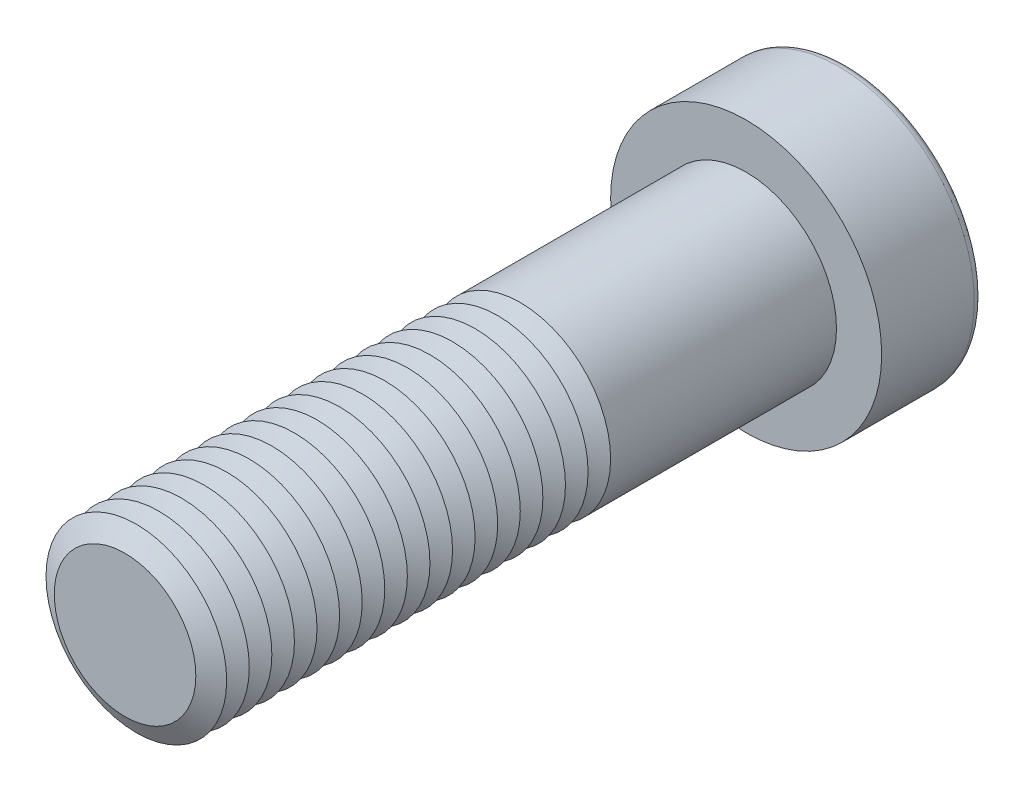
ISO-10303-21;
HEADER;
FILE_DESCRIPTION(('STEP AP214'),'2;1');
FILE_NAME('part.step','',(''),(''),'','','');
FILE_SCHEMA(('AUTOMOTIVE_DESIGN { 1 0 10303 214 1 1 1 1 }'));
ENDSEC;
DATA;
#1=APPLICATION_CONTEXT('core data for automotive mechanical design processes');
#2=APPLICATION_PROTOCOL_DEFINITION('international standard','automotive_design',2000,#1);
#3=PRODUCT_CONTEXT('',#1,'mechanical');
#4=PRODUCT('Part','Part','',(#3));
#5=PRODUCT_RELATED_PRODUCT_CATEGORY('part','',(#4));
#6=PRODUCT_DEFINITION_FORMATION('','',#4);
#7=PRODUCT_DEFINITION_CONTEXT('part definition',#1,'design');
#8=PRODUCT_DEFINITION('design','',#6,#7);
#9=PRODUCT_DEFINITION_SHAPE('','',#8);
#10=(LENGTH_UNIT() NAMED_UNIT(*) SI_UNIT(.MILLI.,.METRE.));
#11=(NAMED_UNIT(*) PLANE_ANGLE_UNIT() SI_UNIT($,.RADIAN.));
#12=(NAMED_UNIT(*) SI_UNIT($,.STERADIAN.) SOLID_ANGLE_UNIT());
#13=UNCERTAINTY_MEASURE_WITH_UNIT(LENGTH_MEASURE(1.E-05),#10,'distance_accuracy_value','');
#14=(GEOMETRIC_REPRESENTATION_CONTEXT(3) GLOBAL_UNCERTAINTY_ASSIGNED_CONTEXT((#13)) GLOBAL_UNIT_ASSIGNED_CONTEXT((#10,
#11,#12)) REPRESENTATION_CONTEXT('',''));
#15=CARTESIAN_POINT('',(0.,0.,0.));
#16=DIRECTION('',(0.,0.,1.));
#17=DIRECTION('',(1.,0.,0.));
#18=AXIS2_PLACEMENT_3D('',#15,#16,#17);
#19=CARTESIAN_POINT('',(0.,0.,48.));
#20=DIRECTION('',(0.,0.,1.));
#21=DIRECTION('',(1.,0.,0.));
#22=AXIS2_PLACEMENT_3D('',#19,#20,#21);
#23=CONICAL_SURFACE('',#22,8.,1.0471975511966);
#24=CARTESIAN_POINT('',(0.,0.,47.));
#25=DIRECTION('',(0.,0.,1.));
#26=DIRECTION('',(1.,0.,0.));
#27=AXIS2_PLACEMENT_3D('',#24,#25,#26);
#28=CIRCLE('',#27,6.26794919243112);
#29=CARTESIAN_POINT('',(6.26794919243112,0.,47.));
#30=VERTEX_POINT('',#29);
#31=EDGE_CURVE('E314',#30,#30,#28,.T.);
#32=ORIENTED_EDGE('',*,*,#31,.T.);
#33=EDGE_LOOP('',(#32));
#34=FACE_BOUND('',#33,.T.);
#35=CARTESIAN_POINT('',(0.,0.,48.));
#36=DIRECTION('',(0.,0.,1.));
#37=DIRECTION('',(1.,0.,0.));
#38=AXIS2_PLACEMENT_3D('',#35,#36,#37);
#39=CIRCLE('',#38,8.);
#40=CARTESIAN_POINT('',(8.,0.,48.));
#41=VERTEX_POINT('',#40);
#42=EDGE_CURVE('E317',#41,#41,#39,.T.);
#43=ORIENTED_EDGE('',*,*,#42,.F.);
#44=EDGE_LOOP('',(#43));
#45=FACE_BOUND('',#44,.T.);
#46=ADVANCED_FACE('F39',(#34,#45),#23,.T.);
#47=CARTESIAN_POINT('',(0.,0.,47.));
#48=DIRECTION('',(0.,0.,-1.));
#49=DIRECTION('',(-1.,0.,0.));
#50=AXIS2_PLACEMENT_3D('',#47,#48,#49);
#51=CONICAL_SURFACE('',#50,6.26794919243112,1.0471975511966);
#52=CARTESIAN_POINT('',(0.,0.,46.));
#53=DIRECTION('',(0.,0.,1.));
#54=DIRECTION('',(1.,0.,0.));
#55=AXIS2_PLACEMENT_3D('',#52,#53,#54);
#56=CIRCLE('',#55,8.);
#57=CARTESIAN_POINT('',(8.,0.,46.));
#58=VERTEX_POINT('',#57);
#59=EDGE_CURVE('E324',#58,#58,#56,.T.);
#60=ORIENTED_EDGE('',*,*,#59,.T.);
#61=EDGE_LOOP('',(#60));
#62=FACE_BOUND('',#61,.T.);
#63=ORIENTED_EDGE('',*,*,#31,.F.);
#64=EDGE_LOOP('',(#63));
#65=FACE_BOUND('',#64,.T.);
#66=ADVANCED_FACE('F245',(#62,#65),#51,.T.);
#67=CARTESIAN_POINT('',(0.,0.,55.));
#68=DIRECTION('',(0.,0.,1.));
#69=DIRECTION('',(1.,0.,0.));
#70=AXIS2_PLACEMENT_3D('',#67,#68,#69);
#71=PLANE('',#70);
#72=CARTESIAN_POINT('',(0.,0.,55.));
#73=DIRECTION('',(0.,0.,1.));
#74=DIRECTION('',(1.,0.,0.));
#75=AXIS2_PLACEMENT_3D('',#72,#73,#74);
#76=CIRCLE('',#75,6.26794919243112);
#77=CARTESIAN_POINT('',(6.26794919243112,0.,55.));
#78=VERTEX_POINT('',#77);
#79=EDGE_CURVE('E174',#78,#78,#76,.T.);
#80=ORIENTED_EDGE('',*,*,#79,.T.);
#81=EDGE_LOOP('',(#80));
#82=FACE_BOUND('',#81,.T.);
#83=ADVANCED_FACE('F251',(#82),#71,.T.);
#84=CARTESIAN_POINT('',(0.,0.,55.));
#85=DIRECTION('',(0.,0.,-1.));
#86=DIRECTION('',(-1.,0.,0.));
#87=AXIS2_PLACEMENT_3D('',#84,#85,#86);
#88=CONICAL_SURFACE('',#87,6.26794919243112,1.0471975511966);
#89=CARTESIAN_POINT('',(0.,0.,54.));
#90=DIRECTION('',(0.,0.,1.));
#91=DIRECTION('',(1.,0.,0.));
#92=AXIS2_PLACEMENT_3D('',#89,#90,#91);
#93=CIRCLE('',#92,8.);
#94=CARTESIAN_POINT('',(8.,0.,54.));
#95=VERTEX_POINT('',#94);
#96=EDGE_CURVE('E291',#95,#95,#93,.T.);
#97=ORIENTED_EDGE('',*,*,#96,.T.);
#98=EDGE_LOOP('',(#97));
#99=FACE_BOUND('',#98,.T.);
#100=ORIENTED_EDGE('',*,*,#79,.F.);
#101=EDGE_LOOP('',(#100));
#102=FACE_BOUND('',#101,.T.);
#103=ADVANCED_FACE('F199',(#99,#102),#88,.T.);
#104=CARTESIAN_POINT('',(0.,0.,54.));
#105=DIRECTION('',(0.,0.,1.));
#106=DIRECTION('',(1.,0.,0.));
#107=AXIS2_PLACEMENT_3D('',#104,#105,#106);
#108=CONICAL_SURFACE('',#107,8.,1.0471975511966);
#109=CARTESIAN_POINT('',(0.,0.,53.));
#110=DIRECTION('',(0.,0.,1.));
#111=DIRECTION('',(1.,0.,0.));
#112=AXIS2_PLACEMENT_3D('',#109,#110,#111);
#113=CIRCLE('',#112,6.26794919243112);
#114=CARTESIAN_POINT('',(6.26794919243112,0.,53.));
#115=VERTEX_POINT('',#114);
#116=EDGE_CURVE('E288',#115,#115,#113,.T.);
#117=ORIENTED_EDGE('',*,*,#116,.T.);
#118=EDGE_LOOP('',(#117));
#119=FACE_BOUND('',#118,.T.);
#120=ORIENTED_EDGE('',*,*,#96,.F.);
#121=EDGE_LOOP('',(#120));
#122=FACE_BOUND('',#121,.T.);
#123=ADVANCED_FACE('F277',(#119,#122),#108,.T.);
#124=CARTESIAN_POINT('',(0.,0.,53.));
#125=DIRECTION('',(0.,0.,-1.));
#126=DIRECTION('',(-1.,0.,0.));
#127=AXIS2_PLACEMENT_3D('',#124,#125,#126);
#128=CONICAL_SURFACE('',#127,6.26794919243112,1.0471975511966);
#129=CARTESIAN_POINT('',(0.,0.,52.));
#130=DIRECTION('',(0.,0.,1.));
#131=DIRECTION('',(1.,0.,0.));
#132=AXIS2_PLACEMENT_3D('',#129,#130,#131);
#133=CIRCLE('',#132,8.);
#134=CARTESIAN_POINT('',(8.,0.,52.));
#135=VERTEX_POINT('',#134);
#136=EDGE_CURVE('E300',#135,#135,#133,.T.);
#137=ORIENTED_EDGE('',*,*,#136,.T.);
#138=EDGE_LOOP('',(#137));
#139=FACE_BOUND('',#138,.T.);
#140=ORIENTED_EDGE('',*,*,#116,.F.);
#141=EDGE_LOOP('',(#140));
#142=FACE_BOUND('',#141,.T.);
#143=ADVANCED_FACE('F274',(#139,#142),#128,.T.);
#144=CARTESIAN_POINT('',(0.,0.,52.));
#145=DIRECTION('',(0.,0.,1.));
#146=DIRECTION('',(1.,0.,0.));
#147=AXIS2_PLACEMENT_3D('',#144,#145,#146);
#148=CONICAL_SURFACE('',#147,8.,1.0471975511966);
#149=CARTESIAN_POINT('',(0.,0.,51.));
#150=DIRECTION('',(0.,0.,1.));
#151=DIRECTION('',(1.,0.,0.));
#152=AXIS2_PLACEMENT_3D('',#149,#150,#151);
#153=CIRCLE('',#152,6.26794919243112);
#154=CARTESIAN_POINT('',(6.26794919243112,0.,51.));
#155=VERTEX_POINT('',#154);
#156=EDGE_CURVE('E293',#155,#155,#153,.T.);
#157=ORIENTED_EDGE('',*,*,#156,.T.);
#158=EDGE_LOOP('',(#157));
#159=FACE_BOUND('',#158,.T.);
#160=ORIENTED_EDGE('',*,*,#136,.F.);
#161=EDGE_LOOP('',(#160));
#162=FACE_BOUND('',#161,.T.);
#163=ADVANCED_FACE('F270',(#159,#162),#148,.T.);
#164=CARTESIAN_POINT('',(0.,0.,51.));
#165=DIRECTION('',(0.,0.,-1.));
#166=DIRECTION('',(-1.,0.,0.));
#167=AXIS2_PLACEMENT_3D('',#164,#165,#166);
#168=CONICAL_SURFACE('',#167,6.26794919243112,1.0471975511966);
#169=CARTESIAN_POINT('',(0.,0.,50.));
#170=DIRECTION('',(0.,0.,1.));
#171=DIRECTION('',(1.,0.,0.));
#172=AXIS2_PLACEMENT_3D('',#169,#170,#171);
#173=CIRCLE('',#172,8.);
#174=CARTESIAN_POINT('',(8.,0.,50.));
#175=VERTEX_POINT('',#174);
#176=EDGE_CURVE('E310',#175,#175,#173,.T.);
#177=ORIENTED_EDGE('',*,*,#176,.T.);
#178=EDGE_LOOP('',(#177));
#179=FACE_BOUND('',#178,.T.);
#180=ORIENTED_EDGE('',*,*,#156,.F.);
#181=EDGE_LOOP('',(#180));
#182=FACE_BOUND('',#181,.T.);
#183=ADVANCED_FACE('F266',(#179,#182),#168,.T.);
#184=CARTESIAN_POINT('',(0.,0.,50.));
#185=DIRECTION('',(0.,0.,1.));
#186=DIRECTION('',(1.,0.,0.));
#187=AXIS2_PLACEMENT_3D('',#184,#185,#186);
#188=CONICAL_SURFACE('',#187,8.,1.0471975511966);
#189=CARTESIAN_POINT('',(0.,0.,49.));
#190=DIRECTION('',(0.,0.,1.));
#191=DIRECTION('',(1.,0.,0.));
#192=AXIS2_PLACEMENT_3D('',#189,#190,#191);
#193=CIRCLE('',#192,6.26794919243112);
#194=CARTESIAN_POINT('',(6.26794919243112,0.,49.));
#195=VERTEX_POINT('',#194);
#196=EDGE_CURVE('E306',#195,#195,#193,.T.);
#197=ORIENTED_EDGE('',*,*,#196,.T.);
#198=EDGE_LOOP('',(#197));
#199=FACE_BOUND('',#198,.T.);
#200=ORIENTED_EDGE('',*,*,#176,.F.);
#201=EDGE_LOOP('',(#200));
#202=FACE_BOUND('',#201,.T.);
#203=ADVANCED_FACE('F262',(#199,#202),#188,.T.);
#204=CARTESIAN_POINT('',(0.,0.,49.));
#205=DIRECTION('',(0.,0.,-1.));
#206=DIRECTION('',(-1.,0.,0.));
#207=AXIS2_PLACEMENT_3D('',#204,#205,#206);
#208=CONICAL_SURFACE('',#207,6.26794919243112,1.0471975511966);
#209=ORIENTED_EDGE('',*,*,#42,.T.);
#210=EDGE_LOOP('',(#209));
#211=FACE_BOUND('',#210,.T.);
#212=ORIENTED_EDGE('',*,*,#196,.F.);
#213=EDGE_LOOP('',(#212));
#214=FACE_BOUND('',#213,.T.);
#215=ADVANCED_FACE('F258',(#211,#214),#208,.T.);
#216=CARTESIAN_POINT('',(0.,0.,46.));
#217=DIRECTION('',(0.,0.,1.));
#218=DIRECTION('',(1.,0.,0.));
#219=AXIS2_PLACEMENT_3D('',#216,#217,#218);
#220=CONICAL_SURFACE('',#219,8.,1.0471975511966);
#221=CARTESIAN_POINT('',(0.,0.,45.));
#222=DIRECTION('',(0.,0.,1.));
#223=DIRECTION('',(1.,0.,0.));
#224=AXIS2_PLACEMENT_3D('',#221,#222,#223);
#225=CIRCLE('',#224,6.26794919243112);
#226=CARTESIAN_POINT('',(6.26794919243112,0.,45.));
#227=VERTEX_POINT('',#226);
#228=EDGE_CURVE('E321',#227,#227,#225,.T.);
#229=ORIENTED_EDGE('',*,*,#228,.T.);
#230=EDGE_LOOP('',(#229));
#231=FACE_BOUND('',#230,.T.);
#232=ORIENTED_EDGE('',*,*,#59,.F.);
#233=EDGE_LOOP('',(#232));
#234=FACE_BOUND('',#233,.T.);
#235=ADVANCED_FACE('F261',(#231,#234),#220,.T.);
#236=CARTESIAN_POINT('',(0.,0.,45.));
#237=DIRECTION('',(0.,0.,-1.));
#238=DIRECTION('',(-1.,0.,0.));
#239=AXIS2_PLACEMENT_3D('',#236,#237,#238);
#240=CONICAL_SURFACE('',#239,6.26794919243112,1.0471975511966);
#241=CARTESIAN_POINT('',(0.,0.,44.));
#242=DIRECTION('',(0.,0.,1.));
#243=DIRECTION('',(1.,0.,0.));
#244=AXIS2_PLACEMENT_3D('',#241,#242,#243);
#245=CIRCLE('',#244,8.);
#246=CARTESIAN_POINT('',(8.,0.,44.));
#247=VERTEX_POINT('',#246);
#248=EDGE_CURVE('E332',#247,#247,#245,.T.);
#249=ORIENTED_EDGE('',*,*,#248,.T.);
#250=EDGE_LOOP('',(#249));
#251=FACE_BOUND('',#250,.T.);
#252=ORIENTED_EDGE('',*,*,#228,.F.);
#253=EDGE_LOOP('',(#252));
#254=FACE_BOUND('',#253,.T.);
#255=ADVANCED_FACE('F528',(#251,#254),#240,.T.);
#256=CARTESIAN_POINT('',(0.,0.,44.));
#257=DIRECTION('',(0.,0.,1.));
#258=DIRECTION('',(1.,0.,0.));
#259=AXIS2_PLACEMENT_3D('',#256,#257,#258);
#260=CONICAL_SURFACE('',#259,8.,1.0471975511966);
#261=CARTESIAN_POINT('',(0.,0.,43.));
#262=DIRECTION('',(0.,0.,1.));
#263=DIRECTION('',(1.,0.,0.));
#264=AXIS2_PLACEMENT_3D('',#261,#262,#263);
#265=CIRCLE('',#264,6.26794919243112);
#266=CARTESIAN_POINT('',(6.26794919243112,0.,43.));
#267=VERTEX_POINT('',#266);
#268=EDGE_CURVE('E328',#267,#267,#265,.T.);
#269=ORIENTED_EDGE('',*,*,#268,.T.);
#270=EDGE_LOOP('',(#269));
#271=FACE_BOUND('',#270,.T.);
#272=ORIENTED_EDGE('',*,*,#248,.F.);
#273=EDGE_LOOP('',(#272));
#274=FACE_BOUND('',#273,.T.);
#275=ADVANCED_FACE('F524',(#271,#274),#260,.T.);
#276=CARTESIAN_POINT('',(0.,0.,43.));
#277=DIRECTION('',(0.,0.,-1.));
#278=DIRECTION('',(-1.,0.,0.));
#279=AXIS2_PLACEMENT_3D('',#276,#277,#278);
#280=CONICAL_SURFACE('',#279,6.26794919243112,1.0471975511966);
#281=CARTESIAN_POINT('',(0.,0.,42.));
#282=DIRECTION('',(0.,0.,1.));
#283=DIRECTION('',(1.,0.,0.));
#284=AXIS2_PLACEMENT_3D('',#281,#282,#283);
#285=CIRCLE('',#284,8.);
#286=CARTESIAN_POINT('',(8.,0.,42.));
#287=VERTEX_POINT('',#286);
#288=EDGE_CURVE('E340',#287,#287,#285,.T.);
#289=ORIENTED_EDGE('',*,*,#288,.T.);
#290=EDGE_LOOP('',(#289));
#291=FACE_BOUND('',#290,.T.);
#292=ORIENTED_EDGE('',*,*,#268,.F.);
#293=EDGE_LOOP('',(#292));
#294=FACE_BOUND('',#293,.T.);
#295=ADVANCED_FACE('F520',(#291,#294),#280,.T.);
#296=CARTESIAN_POINT('',(0.,0.,42.));
#297=DIRECTION('',(0.,0.,1.));
#298=DIRECTION('',(1.,0.,0.));
#299=AXIS2_PLACEMENT_3D('',#296,#297,#298);
#300=CONICAL_SURFACE('',#299,8.,1.0471975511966);
#301=CARTESIAN_POINT('',(0.,0.,41.));
#302=DIRECTION('',(0.,0.,1.));
#303=DIRECTION('',(1.,0.,0.));
#304=AXIS2_PLACEMENT_3D('',#301,#302,#303);
#305=CIRCLE('',#304,6.26794919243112);
#306=CARTESIAN_POINT('',(6.26794919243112,0.,41.));
#307=VERTEX_POINT('',#306);
#308=EDGE_CURVE('E336',#307,#307,#305,.T.);
#309=ORIENTED_EDGE('',*,*,#308,.T.);
#310=EDGE_LOOP('',(#309));
#311=FACE_BOUND('',#310,.T.);
#312=ORIENTED_EDGE('',*,*,#288,.F.);
#313=EDGE_LOOP('',(#312));
#314=FACE_BOUND('',#313,.T.);
#315=ADVANCED_FACE('F516',(#311,#314),#300,.T.);
#316=CARTESIAN_POINT('',(0.,0.,41.));
#317=DIRECTION('',(0.,0.,-1.));
#318=DIRECTION('',(-1.,0.,0.));
#319=AXIS2_PLACEMENT_3D('',#316,#317,#318);
#320=CONICAL_SURFACE('',#319,6.26794919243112,1.0471975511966);
#321=CARTESIAN_POINT('',(0.,0.,40.));
#322=DIRECTION('',(0.,0.,1.));
#323=DIRECTION('',(1.,0.,0.));
#324=AXIS2_PLACEMENT_3D('',#321,#322,#323);
#325=CIRCLE('',#324,8.);
#326=CARTESIAN_POINT('',(8.,0.,40.));
#327=VERTEX_POINT('',#326);
#328=EDGE_CURVE('E348',#327,#327,#325,.T.);
#329=ORIENTED_EDGE('',*,*,#328,.T.);
#330=EDGE_LOOP('',(#329));
#331=FACE_BOUND('',#330,.T.);
#332=ORIENTED_EDGE('',*,*,#308,.F.);
#333=EDGE_LOOP('',(#332));
#334=FACE_BOUND('',#333,.T.);
#335=ADVANCED_FACE('F512',(#331,#334),#320,.T.);
#336=CARTESIAN_POINT('',(0.,0.,40.));
#337=DIRECTION('',(0.,0.,1.));
#338=DIRECTION('',(1.,0.,0.));
#339=AXIS2_PLACEMENT_3D('',#336,#337,#338);
#340=CONICAL_SURFACE('',#339,8.,1.0471975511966);
#341=CARTESIAN_POINT('',(0.,0.,39.));
#342=DIRECTION('',(0.,0.,1.));
#343=DIRECTION('',(1.,0.,0.));
#344=AXIS2_PLACEMENT_3D('',#341,#342,#343);
#345=CIRCLE('',#344,6.26794919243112);
#346=CARTESIAN_POINT('',(6.26794919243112,0.,39.));
#347=VERTEX_POINT('',#346);
#348=EDGE_CURVE('E344',#347,#347,#345,.T.);
#349=ORIENTED_EDGE('',*,*,#348,.T.);
#350=EDGE_LOOP('',(#349));
#351=FACE_BOUND('',#350,.T.);
#352=ORIENTED_EDGE('',*,*,#328,.F.);
#353=EDGE_LOOP('',(#352));
#354=FACE_BOUND('',#353,.T.);
#355=ADVANCED_FACE('F508',(#351,#354),#340,.T.);
#356=CARTESIAN_POINT('',(0.,0.,39.));
#357=DIRECTION('',(0.,0.,-1.));
#358=DIRECTION('',(-1.,0.,0.));
#359=AXIS2_PLACEMENT_3D('',#356,#357,#358);
#360=CONICAL_SURFACE('',#359,6.26794919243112,1.0471975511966);
#361=CARTESIAN_POINT('',(0.,0.,38.));
#362=DIRECTION('',(0.,0.,1.));
#363=DIRECTION('',(1.,0.,0.));
#364=AXIS2_PLACEMENT_3D('',#361,#362,#363);
#365=CIRCLE('',#364,8.);
#366=CARTESIAN_POINT('',(8.,0.,38.));
#367=VERTEX_POINT('',#366);
#368=EDGE_CURVE('E356',#367,#367,#365,.T.);
#369=ORIENTED_EDGE('',*,*,#368,.T.);
#370=EDGE_LOOP('',(#369));
#371=FACE_BOUND('',#370,.T.);
#372=ORIENTED_EDGE('',*,*,#348,.F.);
#373=EDGE_LOOP('',(#372));
#374=FACE_BOUND('',#373,.T.);
#375=ADVANCED_FACE('F504',(#371,#374),#360,.T.);
#376=CARTESIAN_POINT('',(0.,0.,38.));
#377=DIRECTION('',(0.,0.,1.));
#378=DIRECTION('',(1.,0.,0.));
#379=AXIS2_PLACEMENT_3D('',#376,#377,#378);
#380=CONICAL_SURFACE('',#379,8.,1.0471975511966);
#381=CARTESIAN_POINT('',(0.,0.,37.));
#382=DIRECTION('',(0.,0.,1.));
#383=DIRECTION('',(1.,0.,0.));
#384=AXIS2_PLACEMENT_3D('',#381,#382,#383);
#385=CIRCLE('',#384,6.26794919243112);
#386=CARTESIAN_POINT('',(6.26794919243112,0.,37.));
#387=VERTEX_POINT('',#386);
#388=EDGE_CURVE('E352',#387,#387,#385,.T.);
#389=ORIENTED_EDGE('',*,*,#388,.T.);
#390=EDGE_LOOP('',(#389));
#391=FACE_BOUND('',#390,.T.);
#392=ORIENTED_EDGE('',*,*,#368,.F.);
#393=EDGE_LOOP('',(#392));
#394=FACE_BOUND('',#393,.T.);
#395=ADVANCED_FACE('F500',(#391,#394),#380,.T.);
#396=CARTESIAN_POINT('',(0.,0.,37.));
#397=DIRECTION('',(0.,0.,-1.));
#398=DIRECTION('',(-1.,0.,0.));
#399=AXIS2_PLACEMENT_3D('',#396,#397,#398);
#400=CONICAL_SURFACE('',#399,6.26794919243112,1.0471975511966);
#401=CARTESIAN_POINT('',(0.,0.,36.));
#402=DIRECTION('',(0.,0.,1.));
#403=DIRECTION('',(1.,0.,0.));
#404=AXIS2_PLACEMENT_3D('',#401,#402,#403);
#405=CIRCLE('',#404,8.);
#406=CARTESIAN_POINT('',(8.,0.,36.));
#407=VERTEX_POINT('',#406);
#408=EDGE_CURVE('E364',#407,#407,#405,.T.);
#409=ORIENTED_EDGE('',*,*,#408,.T.);
#410=EDGE_LOOP('',(#409));
#411=FACE_BOUND('',#410,.T.);
#412=ORIENTED_EDGE('',*,*,#388,.F.);
#413=EDGE_LOOP('',(#412));
#414=FACE_BOUND('',#413,.T.);
#415=ADVANCED_FACE('F496',(#411,#414),#400,.T.);
#416=CARTESIAN_POINT('',(0.,0.,36.));
#417=DIRECTION('',(0.,0.,1.));
#418=DIRECTION('',(1.,0.,0.));
#419=AXIS2_PLACEMENT_3D('',#416,#417,#418);
#420=CONICAL_SURFACE('',#419,8.,1.0471975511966);
#421=CARTESIAN_POINT('',(0.,0.,35.));
#422=DIRECTION('',(0.,0.,1.));
#423=DIRECTION('',(1.,0.,0.));
#424=AXIS2_PLACEMENT_3D('',#421,#422,#423);
#425=CIRCLE('',#424,6.26794919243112);
#426=CARTESIAN_POINT('',(6.26794919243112,0.,35.));
#427=VERTEX_POINT('',#426);
#428=EDGE_CURVE('E360',#427,#427,#425,.T.);
#429=ORIENTED_EDGE('',*,*,#428,.T.);
#430=EDGE_LOOP('',(#429));
#431=FACE_BOUND('',#430,.T.);
#432=ORIENTED_EDGE('',*,*,#408,.F.);
#433=EDGE_LOOP('',(#432));
#434=FACE_BOUND('',#433,.T.);
#435=ADVANCED_FACE('F492',(#431,#434),#420,.T.);
#436=CARTESIAN_POINT('',(0.,0.,35.));
#437=DIRECTION('',(0.,0.,-1.));
#438=DIRECTION('',(-1.,0.,0.));
#439=AXIS2_PLACEMENT_3D('',#436,#437,#438);
#440=CONICAL_SURFACE('',#439,6.26794919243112,1.0471975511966);
#441=CARTESIAN_POINT('',(0.,0.,34.));
#442=DIRECTION('',(0.,0.,1.));
#443=DIRECTION('',(1.,0.,0.));
#444=AXIS2_PLACEMENT_3D('',#441,#442,#443);
#445=CIRCLE('',#444,8.);
#446=CARTESIAN_POINT('',(8.,0.,34.));
#447=VERTEX_POINT('',#446);
#448=EDGE_CURVE('E372',#447,#447,#445,.T.);
#449=ORIENTED_EDGE('',*,*,#448,.T.);
#450=EDGE_LOOP('',(#449));
#451=FACE_BOUND('',#450,.T.);
#452=ORIENTED_EDGE('',*,*,#428,.F.);
#453=EDGE_LOOP('',(#452));
#454=FACE_BOUND('',#453,.T.);
#455=ADVANCED_FACE('F488',(#451,#454),#440,.T.);
#456=CARTESIAN_POINT('',(0.,0.,34.));
#457=DIRECTION('',(0.,0.,1.));
#458=DIRECTION('',(1.,0.,0.));
#459=AXIS2_PLACEMENT_3D('',#456,#457,#458);
#460=CONICAL_SURFACE('',#459,8.,1.0471975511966);
#461=CARTESIAN_POINT('',(0.,0.,33.));
#462=DIRECTION('',(0.,0.,1.));
#463=DIRECTION('',(1.,0.,0.));
#464=AXIS2_PLACEMENT_3D('',#461,#462,#463);
#465=CIRCLE('',#464,6.26794919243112);
#466=CARTESIAN_POINT('',(6.26794919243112,0.,33.));
#467=VERTEX_POINT('',#466);
#468=EDGE_CURVE('E368',#467,#467,#465,.T.);
#469=ORIENTED_EDGE('',*,*,#468,.T.);
#470=EDGE_LOOP('',(#469));
#471=FACE_BOUND('',#470,.T.);
#472=ORIENTED_EDGE('',*,*,#448,.F.);
#473=EDGE_LOOP('',(#472));
#474=FACE_BOUND('',#473,.T.);
#475=ADVANCED_FACE('F484',(#471,#474),#460,.T.);
#476=CARTESIAN_POINT('',(0.,0.,33.));
#477=DIRECTION('',(0.,0.,-1.));
#478=DIRECTION('',(-1.,0.,0.));
#479=AXIS2_PLACEMENT_3D('',#476,#477,#478);
#480=CONICAL_SURFACE('',#479,6.26794919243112,1.0471975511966);
#481=CARTESIAN_POINT('',(0.,0.,32.));
#482=DIRECTION('',(0.,0.,1.));
#483=DIRECTION('',(1.,0.,0.));
#484=AXIS2_PLACEMENT_3D('',#481,#482,#483);
#485=CIRCLE('',#484,8.);
#486=CARTESIAN_POINT('',(8.,0.,32.));
#487=VERTEX_POINT('',#486);
#488=EDGE_CURVE('E380',#487,#487,#485,.T.);
#489=ORIENTED_EDGE('',*,*,#488,.T.);
#490=EDGE_LOOP('',(#489));
#491=FACE_BOUND('',#490,.T.);
#492=ORIENTED_EDGE('',*,*,#468,.F.);
#493=EDGE_LOOP('',(#492));
#494=FACE_BOUND('',#493,.T.);
#495=ADVANCED_FACE('F480',(#491,#494),#480,.T.);
#496=CARTESIAN_POINT('',(0.,0.,32.));
#497=DIRECTION('',(0.,0.,1.));
#498=DIRECTION('',(1.,0.,0.));
#499=AXIS2_PLACEMENT_3D('',#496,#497,#498);
#500=CONICAL_SURFACE('',#499,8.,1.0471975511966);
#501=CARTESIAN_POINT('',(0.,0.,31.));
#502=DIRECTION('',(0.,0.,1.));
#503=DIRECTION('',(1.,0.,0.));
#504=AXIS2_PLACEMENT_3D('',#501,#502,#503);
#505=CIRCLE('',#504,6.26794919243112);
#506=CARTESIAN_POINT('',(6.26794919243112,0.,31.));
#507=VERTEX_POINT('',#506);
#508=EDGE_CURVE('E376',#507,#507,#505,.T.);
#509=ORIENTED_EDGE('',*,*,#508,.T.);
#510=EDGE_LOOP('',(#509));
#511=FACE_BOUND('',#510,.T.);
#512=ORIENTED_EDGE('',*,*,#488,.F.);
#513=EDGE_LOOP('',(#512));
#514=FACE_BOUND('',#513,.T.);
#515=ADVANCED_FACE('F476',(#511,#514),#500,.T.);
#516=CARTESIAN_POINT('',(0.,0.,31.));
#517=DIRECTION('',(0.,0.,-1.));
#518=DIRECTION('',(-1.,0.,0.));
#519=AXIS2_PLACEMENT_3D('',#516,#517,#518);
#520=CONICAL_SURFACE('',#519,6.26794919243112,1.0471975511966);
#521=CARTESIAN_POINT('',(0.,0.,30.));
#522=DIRECTION('',(0.,0.,1.));
#523=DIRECTION('',(1.,0.,0.));
#524=AXIS2_PLACEMENT_3D('',#521,#522,#523);
#525=CIRCLE('',#524,8.);
#526=CARTESIAN_POINT('',(8.,0.,30.));
#527=VERTEX_POINT('',#526);
#528=EDGE_CURVE('E388',#527,#527,#525,.T.);
#529=ORIENTED_EDGE('',*,*,#528,.T.);
#530=EDGE_LOOP('',(#529));
#531=FACE_BOUND('',#530,.T.);
#532=ORIENTED_EDGE('',*,*,#508,.F.);
#533=EDGE_LOOP('',(#532));
#534=FACE_BOUND('',#533,.T.);
#535=ADVANCED_FACE('F472',(#531,#534),#520,.T.);
#536=CARTESIAN_POINT('',(0.,0.,30.));
#537=DIRECTION('',(0.,0.,1.));
#538=DIRECTION('',(1.,0.,0.));
#539=AXIS2_PLACEMENT_3D('',#536,#537,#538);
#540=CONICAL_SURFACE('',#539,8.,1.0471975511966);
#541=CARTESIAN_POINT('',(0.,0.,29.));
#542=DIRECTION('',(0.,0.,1.));
#543=DIRECTION('',(1.,0.,0.));
#544=AXIS2_PLACEMENT_3D('',#541,#542,#543);
#545=CIRCLE('',#544,6.26794919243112);
#546=CARTESIAN_POINT('',(6.26794919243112,0.,29.));
#547=VERTEX_POINT('',#546);
#548=EDGE_CURVE('E384',#547,#547,#545,.T.);
#549=ORIENTED_EDGE('',*,*,#548,.T.);
#550=EDGE_LOOP('',(#549));
#551=FACE_BOUND('',#550,.T.);
#552=ORIENTED_EDGE('',*,*,#528,.F.);
#553=EDGE_LOOP('',(#552));
#554=FACE_BOUND('',#553,.T.);
#555=ADVANCED_FACE('F468',(#551,#554),#540,.T.);
#556=CARTESIAN_POINT('',(0.,0.,29.));
#557=DIRECTION('',(0.,0.,-1.));
#558=DIRECTION('',(-1.,0.,0.));
#559=AXIS2_PLACEMENT_3D('',#556,#557,#558);
#560=CONICAL_SURFACE('',#559,6.26794919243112,1.0471975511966);
#561=CARTESIAN_POINT('',(0.,0.,28.));
#562=DIRECTION('',(0.,0.,1.));
#563=DIRECTION('',(1.,0.,0.));
#564=AXIS2_PLACEMENT_3D('',#561,#562,#563);
#565=CIRCLE('',#564,8.);
#566=CARTESIAN_POINT('',(8.,0.,28.));
#567=VERTEX_POINT('',#566);
#568=EDGE_CURVE('E396',#567,#567,#565,.T.);
#569=ORIENTED_EDGE('',*,*,#568,.T.);
#570=EDGE_LOOP('',(#569));
#571=FACE_BOUND('',#570,.T.);
#572=ORIENTED_EDGE('',*,*,#548,.F.);
#573=EDGE_LOOP('',(#572));
#574=FACE_BOUND('',#573,.T.);
#575=ADVANCED_FACE('F464',(#571,#574),#560,.T.);
#576=CARTESIAN_POINT('',(0.,0.,28.));
#577=DIRECTION('',(0.,0.,1.));
#578=DIRECTION('',(1.,0.,0.));
#579=AXIS2_PLACEMENT_3D('',#576,#577,#578);
#580=CONICAL_SURFACE('',#579,8.,1.0471975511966);
#581=CARTESIAN_POINT('',(0.,0.,27.));
#582=DIRECTION('',(0.,0.,1.));
#583=DIRECTION('',(1.,0.,0.));
#584=AXIS2_PLACEMENT_3D('',#581,#582,#583);
#585=CIRCLE('',#584,6.26794919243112);
#586=CARTESIAN_POINT('',(6.26794919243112,0.,27.));
#587=VERTEX_POINT('',#586);
#588=EDGE_CURVE('E392',#587,#587,#585,.T.);
#589=ORIENTED_EDGE('',*,*,#588,.T.);
#590=EDGE_LOOP('',(#589));
#591=FACE_BOUND('',#590,.T.);
#592=ORIENTED_EDGE('',*,*,#568,.F.);
#593=EDGE_LOOP('',(#592));
#594=FACE_BOUND('',#593,.T.);
#595=ADVANCED_FACE('F460',(#591,#594),#580,.T.);
#596=CARTESIAN_POINT('',(0.,0.,27.));
#597=DIRECTION('',(0.,0.,-1.));
#598=DIRECTION('',(-1.,0.,0.));
#599=AXIS2_PLACEMENT_3D('',#596,#597,#598);
#600=CONICAL_SURFACE('',#599,6.26794919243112,1.0471975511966);
#601=CARTESIAN_POINT('',(0.,0.,26.));
#602=DIRECTION('',(0.,0.,1.));
#603=DIRECTION('',(1.,0.,0.));
#604=AXIS2_PLACEMENT_3D('',#601,#602,#603);
#605=CIRCLE('',#604,8.);
#606=CARTESIAN_POINT('',(8.,0.,26.));
#607=VERTEX_POINT('',#606);
#608=EDGE_CURVE('E404',#607,#607,#605,.T.);
#609=ORIENTED_EDGE('',*,*,#608,.T.);
#610=EDGE_LOOP('',(#609));
#611=FACE_BOUND('',#610,.T.);
#612=ORIENTED_EDGE('',*,*,#588,.F.);
#613=EDGE_LOOP('',(#612));
#614=FACE_BOUND('',#613,.T.);
#615=ADVANCED_FACE('F456',(#611,#614),#600,.T.);
#616=CARTESIAN_POINT('',(0.,0.,26.));
#617=DIRECTION('',(0.,0.,1.));
#618=DIRECTION('',(1.,0.,0.));
#619=AXIS2_PLACEMENT_3D('',#616,#617,#618);
#620=CONICAL_SURFACE('',#619,8.,1.0471975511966);
#621=CARTESIAN_POINT('',(0.,0.,25.));
#622=DIRECTION('',(0.,0.,1.));
#623=DIRECTION('',(1.,0.,0.));
#624=AXIS2_PLACEMENT_3D('',#621,#622,#623);
#625=CIRCLE('',#624,6.26794919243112);
#626=CARTESIAN_POINT('',(6.26794919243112,0.,25.));
#627=VERTEX_POINT('',#626);
#628=EDGE_CURVE('E400',#627,#627,#625,.T.);
#629=ORIENTED_EDGE('',*,*,#628,.T.);
#630=EDGE_LOOP('',(#629));
#631=FACE_BOUND('',#630,.T.);
#632=ORIENTED_EDGE('',*,*,#608,.F.);
#633=EDGE_LOOP('',(#632));
#634=FACE_BOUND('',#633,.T.);
#635=ADVANCED_FACE('F452',(#631,#634),#620,.T.);
#636=CARTESIAN_POINT('',(0.,0.,25.));
#637=DIRECTION('',(0.,0.,-1.));
#638=DIRECTION('',(-1.,0.,0.));
#639=AXIS2_PLACEMENT_3D('',#636,#637,#638);
#640=CONICAL_SURFACE('',#639,6.26794919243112,1.0471975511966);
#641=CARTESIAN_POINT('',(0.,0.,24.));
#642=DIRECTION('',(0.,0.,1.));
#643=DIRECTION('',(1.,0.,0.));
#644=AXIS2_PLACEMENT_3D('',#641,#642,#643);
#645=CIRCLE('',#644,8.);
#646=CARTESIAN_POINT('',(8.,0.,24.));
#647=VERTEX_POINT('',#646);
#648=EDGE_CURVE('E412',#647,#647,#645,.T.);
#649=ORIENTED_EDGE('',*,*,#648,.T.);
#650=EDGE_LOOP('',(#649));
#651=FACE_BOUND('',#650,.T.);
#652=ORIENTED_EDGE('',*,*,#628,.F.);
#653=EDGE_LOOP('',(#652));
#654=FACE_BOUND('',#653,.T.);
#655=ADVANCED_FACE('F448',(#651,#654),#640,.T.);
#656=CARTESIAN_POINT('',(0.,0.,24.));
#657=DIRECTION('',(0.,0.,1.));
#658=DIRECTION('',(1.,0.,0.));
#659=AXIS2_PLACEMENT_3D('',#656,#657,#658);
#660=CONICAL_SURFACE('',#659,8.,1.0471975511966);
#661=CARTESIAN_POINT('',(0.,0.,23.));
#662=DIRECTION('',(0.,0.,1.));
#663=DIRECTION('',(1.,0.,0.));
#664=AXIS2_PLACEMENT_3D('',#661,#662,#663);
#665=CIRCLE('',#664,6.26794919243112);
#666=CARTESIAN_POINT('',(6.26794919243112,0.,23.));
#667=VERTEX_POINT('',#666);
#668=EDGE_CURVE('E408',#667,#667,#665,.T.);
#669=ORIENTED_EDGE('',*,*,#668,.T.);
#670=EDGE_LOOP('',(#669));
#671=FACE_BOUND('',#670,.T.);
#672=ORIENTED_EDGE('',*,*,#648,.F.);
#673=EDGE_LOOP('',(#672));
#674=FACE_BOUND('',#673,.T.);
#675=ADVANCED_FACE('F443',(#671,#674),#660,.T.);
#676=CARTESIAN_POINT('',(0.,0.,23.));
#677=DIRECTION('',(0.,0.,-1.));
#678=DIRECTION('',(-1.,0.,0.));
#679=AXIS2_PLACEMENT_3D('',#676,#677,#678);
#680=CONICAL_SURFACE('',#679,6.26794919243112,1.0471975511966);
#681=CARTESIAN_POINT('',(0.,0.,22.));
#682=DIRECTION('',(0.,0.,1.));
#683=DIRECTION('',(1.,0.,0.));
#684=AXIS2_PLACEMENT_3D('',#681,#682,#683);
#685=CIRCLE('',#684,8.);
#686=CARTESIAN_POINT('',(8.,0.,22.));
#687=VERTEX_POINT('',#686);
#688=EDGE_CURVE('E424',#687,#687,#685,.T.);
#689=ORIENTED_EDGE('',*,*,#688,.T.);
#690=EDGE_LOOP('',(#689));
#691=FACE_BOUND('',#690,.T.);
#692=ORIENTED_EDGE('',*,*,#668,.F.);
#693=EDGE_LOOP('',(#692));
#694=FACE_BOUND('',#693,.T.);
#695=ADVANCED_FACE('F429',(#691,#694),#680,.T.);
#696=CARTESIAN_POINT('',(0.,0.,22.));
#697=DIRECTION('',(0.,0.,1.));
#698=DIRECTION('',(1.,0.,0.));
#699=AXIS2_PLACEMENT_3D('',#696,#697,#698);
#700=CONICAL_SURFACE('',#699,8.,1.0471975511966);
#701=CARTESIAN_POINT('',(0.,0.,21.));
#702=DIRECTION('',(0.,0.,1.));
#703=DIRECTION('',(1.,0.,0.));
#704=AXIS2_PLACEMENT_3D('',#701,#702,#703);
#705=CIRCLE('',#704,6.26794919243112);
#706=CARTESIAN_POINT('',(6.26794919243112,0.,21.));
#707=VERTEX_POINT('',#706);
#708=EDGE_CURVE('E416',#707,#707,#705,.T.);
#709=ORIENTED_EDGE('',*,*,#708,.T.);
#710=EDGE_LOOP('',(#709));
#711=FACE_BOUND('',#710,.T.);
#712=ORIENTED_EDGE('',*,*,#688,.F.);
#713=EDGE_LOOP('',(#712));
#714=FACE_BOUND('',#713,.T.);
#715=ADVANCED_FACE('F432',(#711,#714),#700,.T.);
#716=CARTESIAN_POINT('',(0.,0.,21.));
#717=DIRECTION('',(0.,0.,-1.));
#718=DIRECTION('',(-1.,0.,0.));
#719=AXIS2_PLACEMENT_3D('',#716,#717,#718);
#720=CONICAL_SURFACE('',#719,6.26794919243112,1.0471975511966);
#721=CARTESIAN_POINT('',(0.,0.,20.));
#722=DIRECTION('',(0.,0.,1.));
#723=DIRECTION('',(1.,0.,0.));
#724=AXIS2_PLACEMENT_3D('',#721,#722,#723);
#725=CIRCLE('',#724,8.);
#726=CARTESIAN_POINT('',(8.,0.,20.));
#727=VERTEX_POINT('',#726);
#728=EDGE_CURVE('E420',#727,#727,#725,.T.);
#729=ORIENTED_EDGE('',*,*,#728,.T.);
#730=EDGE_LOOP('',(#729));
#731=FACE_BOUND('',#730,.T.);
#732=ORIENTED_EDGE('',*,*,#708,.F.);
#733=EDGE_LOOP('',(#732));
#734=FACE_BOUND('',#733,.T.);
#735=ADVANCED_FACE('F434',(#731,#734),#720,.T.);
#736=CARTESIAN_POINT('',(0.,0.,0.));
#737=DIRECTION('',(0.,0.,-1.));
#738=DIRECTION('',(-1.,0.,0.));
#739=AXIS2_PLACEMENT_3D('',#736,#737,#738);
#740=CONICAL_SURFACE('',#739,6.,1.0471975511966);
#741=CARTESIAN_POINT('',(0.,0.,3.46410161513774));
#742=VERTEX_POINT('',#741);
#743=VERTEX_LOOP('',#742);
#744=FACE_BOUND('',#743,.T.);
#745=CARTESIAN_POINT('',(0.,0.,0.));
#746=DIRECTION('',(0.,0.,-1.));
#747=DIRECTION('',(-1.,0.,0.));
#748=AXIS2_PLACEMENT_3D('',#745,#746,#747);
#749=CIRCLE('',#748,6.);
#750=CARTESIAN_POINT('',(-5.19615242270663,3.,0.));
#751=VERTEX_POINT('',#750);
#752=CARTESIAN_POINT('',(0.,6.,0.));
#753=VERTEX_POINT('',#752);
#754=EDGE_CURVE('E149',#751,#753,#749,.T.);
#755=ORIENTED_EDGE('',*,*,#754,.T.);
#756=CARTESIAN_POINT('',(0.,0.,0.));
#757=DIRECTION('',(0.,0.,-1.));
#758=DIRECTION('',(-1.,0.,0.));
#759=AXIS2_PLACEMENT_3D('',#756,#757,#758);
#760=CIRCLE('',#759,6.);
#761=CARTESIAN_POINT('',(5.19615242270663,3.,0.));
#762=VERTEX_POINT('',#761);
#763=EDGE_CURVE('E54',#753,#762,#760,.T.);
#764=ORIENTED_EDGE('',*,*,#763,.T.);
#765=CARTESIAN_POINT('',(5.19615242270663,-3.,0.));
#766=VERTEX_POINT('',#765);
#767=EDGE_CURVE('E1057',#762,#766,#760,.T.);
#768=ORIENTED_EDGE('',*,*,#767,.T.);
#769=CARTESIAN_POINT('',(0.,-6.,0.));
#770=VERTEX_POINT('',#769);
#771=EDGE_CURVE('E1055',#766,#770,#760,.T.);
#772=ORIENTED_EDGE('',*,*,#771,.T.);
#773=CARTESIAN_POINT('',(-5.19615242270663,-3.,0.));
#774=VERTEX_POINT('',#773);
#775=EDGE_CURVE('E1050',#770,#774,#760,.T.);
#776=ORIENTED_EDGE('',*,*,#775,.T.);
#777=EDGE_CURVE('E1048',#774,#751,#760,.T.);
#778=ORIENTED_EDGE('',*,*,#777,.T.);
#779=EDGE_LOOP('',(#755,#764,#768,#772,#776,#778));
#780=FACE_BOUND('',#779,.T.);
#781=ADVANCED_FACE('F201',(#744,#780),#740,.F.);
#782=CARTESIAN_POINT('',(0.,0.,0.));
#783=DIRECTION('',(0.,0.,-1.));
#784=DIRECTION('',(-1.,0.,0.));
#785=AXIS2_PLACEMENT_3D('',#782,#783,#784);
#786=PLANE('',#785);
#787=ORIENTED_EDGE('',*,*,#763,.F.);
#788=DIRECTION('',(1.,0.,0.));
#789=VECTOR('',#788,1.);
#790=CARTESIAN_POINT('',(-3.46410161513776,6.,0.));
#791=LINE('',#790,#789);
#792=CARTESIAN_POINT('',(3.46410161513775,6.,0.));
#793=VERTEX_POINT('',#792);
#794=EDGE_CURVE('E1102',#753,#793,#791,.T.);
#795=ORIENTED_EDGE('',*,*,#794,.T.);
#796=DIRECTION('',(0.5,-0.866025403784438,0.));
#797=VECTOR('',#796,1.);
#798=CARTESIAN_POINT('',(3.46410161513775,6.,0.));
#799=LINE('',#798,#797);
#800=EDGE_CURVE('E155',#793,#762,#799,.T.);
#801=ORIENTED_EDGE('',*,*,#800,.T.);
#802=EDGE_LOOP('',(#787,#795,#801));
#803=FACE_BOUND('',#802,.T.);
#804=ADVANCED_FACE('F629',(#803),#786,.T.);
#805=ORIENTED_EDGE('',*,*,#767,.F.);
#806=CARTESIAN_POINT('',(6.92820323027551,0.,0.));
#807=VERTEX_POINT('',#806);
#808=EDGE_CURVE('E1095',#762,#807,#799,.T.);
#809=ORIENTED_EDGE('',*,*,#808,.T.);
#810=DIRECTION('',(-0.5,-0.866025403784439,0.));
#811=VECTOR('',#810,1.);
#812=CARTESIAN_POINT('',(6.92820323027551,0.,0.));
#813=LINE('',#812,#811);
#814=EDGE_CURVE('E1070',#807,#766,#813,.T.);
#815=ORIENTED_EDGE('',*,*,#814,.T.);
#816=EDGE_LOOP('',(#805,#809,#815));
#817=FACE_BOUND('',#816,.T.);
#818=ADVANCED_FACE('F639',(#817),#786,.T.);
#819=ORIENTED_EDGE('',*,*,#771,.F.);
#820=CARTESIAN_POINT('',(3.46410161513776,-6.,0.));
#821=VERTEX_POINT('',#820);
#822=EDGE_CURVE('E1072',#766,#821,#813,.T.);
#823=ORIENTED_EDGE('',*,*,#822,.T.);
#824=DIRECTION('',(-1.,0.,0.));
#825=VECTOR('',#824,1.);
#826=CARTESIAN_POINT('',(3.46410161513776,-6.,0.));
#827=LINE('',#826,#825);
#828=EDGE_CURVE('E1023',#821,#770,#827,.T.);
#829=ORIENTED_EDGE('',*,*,#828,.T.);
#830=EDGE_LOOP('',(#819,#823,#829));
#831=FACE_BOUND('',#830,.T.);
#832=ADVANCED_FACE('F649',(#831),#786,.T.);
#833=ORIENTED_EDGE('',*,*,#775,.F.);
#834=CARTESIAN_POINT('',(-3.46410161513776,-6.,0.));
#835=VERTEX_POINT('',#834);
#836=EDGE_CURVE('E1066',#770,#835,#827,.T.);
#837=ORIENTED_EDGE('',*,*,#836,.T.);
#838=DIRECTION('',(-0.5,0.866025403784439,0.));
#839=VECTOR('',#838,1.);
#840=CARTESIAN_POINT('',(-3.46410161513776,-6.,0.));
#841=LINE('',#840,#839);
#842=EDGE_CURVE('E1068',#835,#774,#841,.T.);
#843=ORIENTED_EDGE('',*,*,#842,.T.);
#844=EDGE_LOOP('',(#833,#837,#843));
#845=FACE_BOUND('',#844,.T.);
#846=ADVANCED_FACE('F657',(#845),#786,.T.);
#847=ORIENTED_EDGE('',*,*,#777,.F.);
#848=CARTESIAN_POINT('',(-6.92820323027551,0.,0.));
#849=VERTEX_POINT('',#848);
#850=EDGE_CURVE('E1074',#774,#849,#841,.T.);
#851=ORIENTED_EDGE('',*,*,#850,.T.);
#852=DIRECTION('',(0.5,0.866025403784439,0.));
#853=VECTOR('',#852,1.);
#854=CARTESIAN_POINT('',(-6.92820323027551,0.,0.));
#855=LINE('',#854,#853);
#856=EDGE_CURVE('E158',#849,#751,#855,.T.);
#857=ORIENTED_EDGE('',*,*,#856,.T.);
#858=EDGE_LOOP('',(#847,#851,#857));
#859=FACE_BOUND('',#858,.T.);
#860=ADVANCED_FACE('F231',(#859),#786,.T.);
#861=ORIENTED_EDGE('',*,*,#754,.F.);
#862=CARTESIAN_POINT('',(-3.46410161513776,6.,0.));
#863=VERTEX_POINT('',#862);
#864=EDGE_CURVE('E1080',#751,#863,#855,.T.);
#865=ORIENTED_EDGE('',*,*,#864,.T.);
#866=EDGE_CURVE('E1098',#863,#753,#791,.T.);
#867=ORIENTED_EDGE('',*,*,#866,.T.);
#868=EDGE_LOOP('',(#861,#865,#867));
#869=FACE_BOUND('',#868,.T.);
#870=ADVANCED_FACE('F641',(#869),#786,.T.);
#871=CARTESIAN_POINT('',(-3.46410161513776,6.,0.));
#872=DIRECTION('',(0.,1.,0.));
#873=DIRECTION('',(0.,0.,1.));
#874=AXIS2_PLACEMENT_3D('',#871,#872,#873);
#875=PLANE('',#874);
#876=DIRECTION('',(0.,0.,-1.));
#877=VECTOR('',#876,1.);
#878=CARTESIAN_POINT('',(-3.46410161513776,6.,0.));
#879=LINE('',#878,#877);
#880=CARTESIAN_POINT('',(-3.46410161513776,6.,-9.));
#881=VERTEX_POINT('',#880);
#882=EDGE_CURVE('E147',#863,#881,#879,.T.);
#883=ORIENTED_EDGE('',*,*,#882,.T.);
#884=CARTESIAN_POINT('',(-9.04322275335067,6.,-10.0515506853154));
#885=CARTESIAN_POINT('',(-8.77229389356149,6.,-9.99107568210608));
#886=CARTESIAN_POINT('',(-8.50119215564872,6.,-9.93136093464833));
#887=CARTESIAN_POINT('',(-7.95855825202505,6.,-9.81386229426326));
#888=CARTESIAN_POINT('',(-7.68702606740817,6.,-9.75607848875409));
#889=CARTESIAN_POINT('',(-7.14318995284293,6.,-9.64279905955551));
#890=CARTESIAN_POINT('',(-6.87088551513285,6.,-9.58730586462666));
#891=CARTESIAN_POINT('',(-6.32570082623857,6.,-9.47922577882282));
#892=CARTESIAN_POINT('',(-6.05282058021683,6.,-9.42663886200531));
#893=CARTESIAN_POINT('',(-5.50875458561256,6.,-9.32550177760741));
#894=CARTESIAN_POINT('',(-5.23757463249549,6.,-9.27692059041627));
#895=CARTESIAN_POINT('',(-4.69446863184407,6.,-9.18413302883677));
#896=CARTESIAN_POINT('',(-4.42254260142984,6.,-9.13992655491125));
#897=CARTESIAN_POINT('',(-3.87790333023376,6.,-9.05690830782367));
#898=CARTESIAN_POINT('',(-3.6051902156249,6.,-9.0180957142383));
#899=CARTESIAN_POINT('',(-3.05890080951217,6.,-8.94703062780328));
#900=CARTESIAN_POINT('',(-2.7853245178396,6.,-8.91477813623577));
#901=CARTESIAN_POINT('',(-2.23425545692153,6.,-8.85776959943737));
#902=CARTESIAN_POINT('',(-1.95675335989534,6.,-8.83310236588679));
#903=CARTESIAN_POINT('',(-1.40107824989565,6.,-8.79298360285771));
#904=CARTESIAN_POINT('',(-1.12290525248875,6.,-8.77753186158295));
#905=CARTESIAN_POINT('',(-0.566293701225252,6.,-8.75674610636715));
#906=CARTESIAN_POINT('',(-0.28785531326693,6.,-8.75140773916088));
#907=CARTESIAN_POINT('',(0.269026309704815,6.,-8.75117360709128));
#908=CARTESIAN_POINT('',(0.547469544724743,6.,-8.75627785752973));
#909=CARTESIAN_POINT('',(1.10511819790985,6.,-8.77664719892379));
#910=CARTESIAN_POINT('',(1.38432206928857,6.,-8.79195380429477));
#911=CARTESIAN_POINT('',(1.94205759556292,6.,-8.83187108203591));
#912=CARTESIAN_POINT('',(2.22058923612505,6.,-8.85648195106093));
#913=CARTESIAN_POINT('',(2.77698779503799,6.,-8.91379497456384));
#914=CARTESIAN_POINT('',(3.0548541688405,6.,-8.94650233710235));
#915=CARTESIAN_POINT('',(3.60969614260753,6.,-9.01868375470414));
#916=CARTESIAN_POINT('',(3.8866717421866,6.,-9.0581578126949));
#917=CARTESIAN_POINT('',(4.44700464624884,6.,-9.14374886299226));
#918=CARTESIAN_POINT('',(4.73033933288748,6.,-9.190012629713));
#919=CARTESIAN_POINT('',(5.29620685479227,6.,-9.28723184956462));
#920=CARTESIAN_POINT('',(5.57873966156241,6.,-9.3381874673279));
#921=CARTESIAN_POINT('',(6.14313105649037,6.,-9.44386031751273));
#922=CARTESIAN_POINT('',(6.42498956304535,6.,-9.49857798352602));
#923=CARTESIAN_POINT('',(6.98810511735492,6.,-9.61103289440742));
#924=CARTESIAN_POINT('',(7.26936215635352,6.,-9.66877018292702));
#925=CARTESIAN_POINT('',(8.11254995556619,6.,-9.84563705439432));
#926=CARTESIAN_POINT('',(8.67372006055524,6.,-9.96838761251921));
#927=CARTESIAN_POINT('',(9.79457370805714,6.,-10.2202420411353));
#928=CARTESIAN_POINT('',(10.3542573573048,6.,-10.3493454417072));
#929=CARTESIAN_POINT('',(11.4657945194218,6.,-10.6103395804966));
#930=CARTESIAN_POINT('',(12.0176605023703,6.,-10.7421773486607));
#931=CARTESIAN_POINT('',(13.1206665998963,6.,-11.0089002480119));
#932=CARTESIAN_POINT('',(13.6718066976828,6.,-11.1437854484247));
#933=CARTESIAN_POINT('',(14.7727697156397,6.,-11.4155878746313));
#934=CARTESIAN_POINT('',(15.3225934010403,6.,-11.5525020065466));
#935=CARTESIAN_POINT('',(16.4217957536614,6.,-11.8280226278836));
#936=CARTESIAN_POINT('',(16.971174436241,6.,-11.9666290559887));
#937=CARTESIAN_POINT('',(17.5204019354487,6.,-12.1058251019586));
#938=B_SPLINE_CURVE_WITH_KNOTS('',3,(#884,#885,#886,#887,#888,#889,#890,#891,#892,#893,#894,
#895,#896,#897,#898,#899,#900,#901,#902,#903,#904,#905,#906,#907,#908,#909,#910,#911,#912,#913,
#914,#915,#916,#917,#918,#919,#920,#921,#922,#923,#924,#925,#926,#927,#928,#929,#930,#931,#932,
#933,#934,#935,#936,#937),.UNSPECIFIED.,.F.,.F.,(4,2,2,2,2,2,2,2,2,2,2,2,2,2,2,2,2,2,2,2,2,2,2,
2,2,2,4),(0.,0.832792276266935,1.6656222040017,2.49931362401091,3.33299760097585,
4.15946050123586,4.98590459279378,5.81222284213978,6.63854125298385,7.47419540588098,
8.30983035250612,9.14510552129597,9.98038191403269,10.8190780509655,11.6577919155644,
12.4970466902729,13.336301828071,14.1975135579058,15.0587555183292,15.9200969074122,
16.7814507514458,18.5047000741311,20.2278221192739,21.929995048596,23.6322066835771,
25.3320460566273,27.0318240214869),.UNSPECIFIED.);
#939=CARTESIAN_POINT('',(3.46410161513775,6.,-9.));
#940=VERTEX_POINT('',#939);
#941=EDGE_CURVE('E124',#881,#940,#938,.T.);
#942=ORIENTED_EDGE('',*,*,#941,.T.);
#943=DIRECTION('',(0.,0.,-1.));
#944=VECTOR('',#943,1.);
#945=CARTESIAN_POINT('',(3.46410161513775,6.,0.));
#946=LINE('',#945,#944);
#947=EDGE_CURVE('E143',#793,#940,#946,.T.);
#948=ORIENTED_EDGE('',*,*,#947,.F.);
#949=ORIENTED_EDGE('',*,*,#794,.F.);
#950=ORIENTED_EDGE('',*,*,#866,.F.);
#951=EDGE_LOOP('',(#883,#942,#948,#949,#950));
#952=FACE_BOUND('',#951,.T.);
#953=ADVANCED_FACE('F141',(#952),#875,.F.);
#954=CARTESIAN_POINT('',(3.46410161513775,6.,0.));
#955=DIRECTION('',(0.866025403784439,0.5,0.));
#956=DIRECTION('',(-0.5,0.866025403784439,0.));
#957=AXIS2_PLACEMENT_3D('',#954,#955,#956);
#958=PLANE('',#957);
#959=ORIENTED_EDGE('',*,*,#947,.T.);
#960=CARTESIAN_POINT('',(3.46398614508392,6.0002,-9.00003094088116));
#961=CARTESIAN_POINT('',(3.60785114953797,5.75101850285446,-8.96146591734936));
#962=CARTESIAN_POINT('',(3.75197700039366,5.5013852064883,-8.92645521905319));
#963=CARTESIAN_POINT('',(4.0407377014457,5.00123700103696,-8.86494467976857));
#964=CARTESIAN_POINT('',(4.18537273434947,4.75072177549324,-8.83844829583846));
#965=CARTESIAN_POINT('',(4.47427486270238,4.25032861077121,-8.79551324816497));
#966=CARTESIAN_POINT('',(4.61854000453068,4.00045405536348,-8.77902338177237));
#967=CARTESIAN_POINT('',(4.90725426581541,3.5003862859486,-8.75691215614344));
#968=CARTESIAN_POINT('',(5.05170334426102,3.2501931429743,-8.75128869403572));
#969=CARTESIAN_POINT('',(5.34060150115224,2.7498068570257,-8.75128869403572));
#970=CARTESIAN_POINT('',(5.48505057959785,2.49961371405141,-8.75691215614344));
#971=CARTESIAN_POINT('',(5.77376484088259,1.99954594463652,-8.77902338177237));
#972=CARTESIAN_POINT('',(5.91802998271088,1.74967138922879,-8.79551324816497));
#973=CARTESIAN_POINT('',(6.20693211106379,1.24927822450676,-8.83844829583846));
#974=CARTESIAN_POINT('',(6.35156714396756,0.998762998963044,-8.86494467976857));
#975=CARTESIAN_POINT('',(6.6403278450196,0.498614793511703,-8.92645521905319));
#976=CARTESIAN_POINT('',(6.78445369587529,0.248981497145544,-8.96146591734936));
#977=CARTESIAN_POINT('',(6.92831870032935,-0.000199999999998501,-9.00003094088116));
#978=B_SPLINE_CURVE_WITH_KNOTS('',3,(#960,#961,#962,#963,#964,#965,#966,#967,#968,#969,#970,
#971,#972,#973,#974,#975,#976,#977),.UNSPECIFIED.,.F.,.F.,(4,2,2,2,2,2,2,2,4),(0.,
0.870954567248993,1.74226232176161,2.60907321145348,3.47571633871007,4.34235946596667,
5.20917035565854,6.08047811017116,6.95143267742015),.UNSPECIFIED.);
#979=CARTESIAN_POINT('',(6.92820323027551,0.,-9.));
#980=VERTEX_POINT('',#979);
#981=EDGE_CURVE('E11',#940,#980,#978,.T.);
#982=ORIENTED_EDGE('',*,*,#981,.T.);
#983=DIRECTION('',(0.,0.,-1.));
#984=VECTOR('',#983,1.);
#985=CARTESIAN_POINT('',(6.92820323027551,0.,0.));
#986=LINE('',#985,#984);
#987=EDGE_CURVE('E157',#807,#980,#986,.T.);
#988=ORIENTED_EDGE('',*,*,#987,.F.);
#989=ORIENTED_EDGE('',*,*,#808,.F.);
#990=ORIENTED_EDGE('',*,*,#800,.F.);
#991=EDGE_LOOP('',(#959,#982,#988,#989,#990));
#992=FACE_BOUND('',#991,.T.);
#993=ADVANCED_FACE('F152',(#992),#958,.F.);
#994=CARTESIAN_POINT('',(6.92820323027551,0.,0.));
#995=DIRECTION('',(0.866025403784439,-0.5,0.));
#996=DIRECTION('',(0.5,0.866025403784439,0.));
#997=AXIS2_PLACEMENT_3D('',#994,#995,#996);
#998=PLANE('',#997);
#999=ORIENTED_EDGE('',*,*,#987,.T.);
#1000=CARTESIAN_POINT('',(6.92831870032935,0.000200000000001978,-9.00003094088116));
#1001=CARTESIAN_POINT('',(6.78445369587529,-0.24898149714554,-8.96146591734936));
#1002=CARTESIAN_POINT('',(6.6403278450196,-0.498614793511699,-8.92645521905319));
#1003=CARTESIAN_POINT('',(6.35156714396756,-0.99876299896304,-8.86494467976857));
#1004=CARTESIAN_POINT('',(6.20693211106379,-1.24927822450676,-8.83844829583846));
#1005=CARTESIAN_POINT('',(5.91802998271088,-1.74967138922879,-8.79551324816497));
#1006=CARTESIAN_POINT('',(5.77376484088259,-1.99954594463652,-8.77902338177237));
#1007=CARTESIAN_POINT('',(5.48505057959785,-2.4996137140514,-8.75691215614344));
#1008=CARTESIAN_POINT('',(5.34060150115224,-2.7498068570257,-8.75128869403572));
#1009=CARTESIAN_POINT('',(5.05170334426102,-3.2501931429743,-8.75128869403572));
#1010=CARTESIAN_POINT('',(4.90725426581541,-3.50038628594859,-8.75691215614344));
#1011=CARTESIAN_POINT('',(4.61854000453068,-4.00045405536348,-8.77902338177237));
#1012=CARTESIAN_POINT('',(4.47427486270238,-4.25032861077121,-8.79551324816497));
#1013=CARTESIAN_POINT('',(4.18537273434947,-4.75072177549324,-8.83844829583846));
#1014=CARTESIAN_POINT('',(4.04073770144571,-5.00123700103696,-8.86494467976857));
#1015=CARTESIAN_POINT('',(3.75197700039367,-5.5013852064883,-8.92645521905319));
#1016=CARTESIAN_POINT('',(3.60785114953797,-5.75101850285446,-8.96146591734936));
#1017=CARTESIAN_POINT('',(3.46398614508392,-6.0002,-9.00003094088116));
#1018=B_SPLINE_CURVE_WITH_KNOTS('',3,(#1000,#1001,#1002,#1003,#1004,#1005,#1006,#1007,#1008,
#1009,#1010,#1011,#1012,#1013,#1014,#1015,#1016,#1017),.UNSPECIFIED.,.F.,.F.,(4,2,2,2,2,2,2,2,
4),(0.,0.870954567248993,1.74226232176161,2.60907321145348,3.47571633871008,4.34235946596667,
5.20917035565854,6.08047811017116,6.95143267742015),.UNSPECIFIED.);
#1019=CARTESIAN_POINT('',(3.46410161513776,-6.,-9.));
#1020=VERTEX_POINT('',#1019);
#1021=EDGE_CURVE('E173',#980,#1020,#1018,.T.);
#1022=ORIENTED_EDGE('',*,*,#1021,.T.);
#1023=DIRECTION('',(0.,0.,-1.));
#1024=VECTOR('',#1023,1.);
#1025=CARTESIAN_POINT('',(3.46410161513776,-6.,0.));
#1026=LINE('',#1025,#1024);
#1027=EDGE_CURVE('E1018',#821,#1020,#1026,.T.);
#1028=ORIENTED_EDGE('',*,*,#1027,.F.);
#1029=ORIENTED_EDGE('',*,*,#822,.F.);
#1030=ORIENTED_EDGE('',*,*,#814,.F.);
#1031=EDGE_LOOP('',(#999,#1022,#1028,#1029,#1030));
#1032=FACE_BOUND('',#1031,.T.);
#1033=ADVANCED_FACE('F191',(#1032),#998,.F.);
#1034=CARTESIAN_POINT('',(3.46410161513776,-6.,0.));
#1035=DIRECTION('',(0.,-1.,0.));
#1036=DIRECTION('',(0.,0.,-1.));
#1037=AXIS2_PLACEMENT_3D('',#1034,#1035,#1036);
#1038=PLANE('',#1037);
#1039=ORIENTED_EDGE('',*,*,#1027,.T.);
#1040=CARTESIAN_POINT('',(-9.04322275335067,-6.,-10.0515506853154));
#1041=CARTESIAN_POINT('',(-8.77229389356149,-6.,-9.99107568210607));
#1042=CARTESIAN_POINT('',(-8.50119215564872,-6.,-9.93136093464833));
#1043=CARTESIAN_POINT('',(-7.95855825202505,-6.,-9.81386229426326));
#1044=CARTESIAN_POINT('',(-7.68702606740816,-6.,-9.75607848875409));
#1045=CARTESIAN_POINT('',(-7.14318995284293,-6.,-9.64279905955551));
#1046=CARTESIAN_POINT('',(-6.87088551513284,-6.,-9.58730586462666));
#1047=CARTESIAN_POINT('',(-6.32570082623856,-6.,-9.47922577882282));
#1048=CARTESIAN_POINT('',(-6.05282058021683,-6.,-9.42663886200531));
#1049=CARTESIAN_POINT('',(-5.50875458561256,-6.,-9.32550177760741));
#1050=CARTESIAN_POINT('',(-5.23757463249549,-6.,-9.27692059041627));
#1051=CARTESIAN_POINT('',(-4.69446863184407,-6.,-9.18413302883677));
#1052=CARTESIAN_POINT('',(-4.42254260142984,-6.,-9.13992655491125));
#1053=CARTESIAN_POINT('',(-3.87790333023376,-6.,-9.05690830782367));
#1054=CARTESIAN_POINT('',(-3.6051902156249,-6.,-9.0180957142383));
#1055=CARTESIAN_POINT('',(-3.05890080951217,-6.,-8.94703062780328));
#1056=CARTESIAN_POINT('',(-2.7853245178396,-6.,-8.91477813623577));
#1057=CARTESIAN_POINT('',(-2.23425545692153,-6.,-8.85776959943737));
#1058=CARTESIAN_POINT('',(-1.95675335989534,-6.,-8.83310236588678));
#1059=CARTESIAN_POINT('',(-1.40107824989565,-6.,-8.79298360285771));
#1060=CARTESIAN_POINT('',(-1.12290525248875,-6.,-8.77753186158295));
#1061=CARTESIAN_POINT('',(-0.56629370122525,-6.,-8.75674610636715));
#1062=CARTESIAN_POINT('',(-0.287855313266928,-6.,-8.75140773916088));
#1063=CARTESIAN_POINT('',(0.269026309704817,-6.,-8.75117360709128));
#1064=CARTESIAN_POINT('',(0.547469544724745,-6.,-8.75627785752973));
#1065=CARTESIAN_POINT('',(1.10511819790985,-6.,-8.77664719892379));
#1066=CARTESIAN_POINT('',(1.38432206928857,-6.,-8.79195380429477));
#1067=CARTESIAN_POINT('',(1.94205759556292,-6.,-8.83187108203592));
#1068=CARTESIAN_POINT('',(2.22058923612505,-6.,-8.85648195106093));
#1069=CARTESIAN_POINT('',(2.77698779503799,-6.,-8.91379497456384));
#1070=CARTESIAN_POINT('',(3.05485416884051,-6.,-8.94650233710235));
#1071=CARTESIAN_POINT('',(3.60969614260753,-6.,-9.01868375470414));
#1072=CARTESIAN_POINT('',(3.8866717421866,-6.,-9.0581578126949));
#1073=CARTESIAN_POINT('',(4.44700464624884,-6.,-9.14374886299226));
#1074=CARTESIAN_POINT('',(4.73033933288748,-6.,-9.190012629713));
#1075=CARTESIAN_POINT('',(5.29620685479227,-6.,-9.28723184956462));
#1076=CARTESIAN_POINT('',(5.57873966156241,-6.,-9.3381874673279));
#1077=CARTESIAN_POINT('',(6.14313105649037,-6.,-9.44386031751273));
#1078=CARTESIAN_POINT('',(6.42498956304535,-6.,-9.49857798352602));
#1079=CARTESIAN_POINT('',(6.98810511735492,-6.,-9.61103289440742));
#1080=CARTESIAN_POINT('',(7.26936215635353,-6.,-9.66877018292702));
#1081=CARTESIAN_POINT('',(8.11254995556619,-6.,-9.84563705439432));
#1082=CARTESIAN_POINT('',(8.67372006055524,-6.,-9.96838761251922));
#1083=CARTESIAN_POINT('',(9.79457370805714,-6.,-10.2202420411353));
#1084=CARTESIAN_POINT('',(10.3542573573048,-6.,-10.3493454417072));
#1085=CARTESIAN_POINT('',(11.4657945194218,-6.,-10.6103395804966));
#1086=CARTESIAN_POINT('',(12.0176605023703,-6.,-10.7421773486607));
#1087=CARTESIAN_POINT('',(13.1206665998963,-6.,-11.0089002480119));
#1088=CARTESIAN_POINT('',(13.6718066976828,-6.,-11.1437854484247));
#1089=CARTESIAN_POINT('',(14.7727697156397,-6.,-11.4155878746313));
#1090=CARTESIAN_POINT('',(15.3225934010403,-6.,-11.5525020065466));
#1091=CARTESIAN_POINT('',(16.4217957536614,-6.,-11.8280226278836));
#1092=CARTESIAN_POINT('',(16.971174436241,-6.,-11.9666290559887));
#1093=CARTESIAN_POINT('',(17.5204019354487,-6.,-12.1058251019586));
#1094=B_SPLINE_CURVE_WITH_KNOTS('',3,(#1040,#1041,#1042,#1043,#1044,#1045,#1046,#1047,#1048,
#1049,#1050,#1051,#1052,#1053,#1054,#1055,#1056,#1057,#1058,#1059,#1060,#1061,#1062,#1063,#1064,
#1065,#1066,#1067,#1068,#1069,#1070,#1071,#1072,#1073,#1074,#1075,#1076,#1077,#1078,#1079,#1080,
#1081,#1082,#1083,#1084,#1085,#1086,#1087,#1088,#1089,#1090,#1091,#1092,#1093),.UNSPECIFIED.,
.F.,.F.,(4,2,2,2,2,2,2,2,2,2,2,2,2,2,2,2,2,2,2,2,2,2,2,2,2,2,4),(0.,0.832792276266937,
1.6656222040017,2.49931362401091,3.33299760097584,4.15946050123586,4.98590459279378,
5.81222284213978,6.63854125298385,7.47419540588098,8.30983035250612,9.14510552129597,
9.98038191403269,10.8190780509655,11.6577919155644,12.4970466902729,13.336301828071,
14.1975135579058,15.0587555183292,15.9200969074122,16.7814507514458,18.5047000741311,
20.2278221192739,21.929995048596,23.6322066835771,25.3320460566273,27.0318240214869),.UNSPECIFIED.);
#1095=CARTESIAN_POINT('',(-3.46410161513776,-6.,-9.));
#1096=VERTEX_POINT('',#1095);
#1097=EDGE_CURVE('E184',#1020,#1096,#1094,.F.);
#1098=ORIENTED_EDGE('',*,*,#1097,.T.);
#1099=DIRECTION('',(0.,0.,-1.));
#1100=VECTOR('',#1099,1.);
#1101=CARTESIAN_POINT('',(-3.46410161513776,-6.,0.));
#1102=LINE('',#1101,#1100);
#1103=EDGE_CURVE('E1025',#835,#1096,#1102,.T.);
#1104=ORIENTED_EDGE('',*,*,#1103,.F.);
#1105=ORIENTED_EDGE('',*,*,#836,.F.);
#1106=ORIENTED_EDGE('',*,*,#828,.F.);
#1107=EDGE_LOOP('',(#1039,#1098,#1104,#1105,#1106));
#1108=FACE_BOUND('',#1107,.T.);
#1109=ADVANCED_FACE('F234',(#1108),#1038,.F.);
#1110=CARTESIAN_POINT('',(-3.46410161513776,-6.,0.));
#1111=DIRECTION('',(-0.866025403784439,-0.5,0.));
#1112=DIRECTION('',(0.5,-0.866025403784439,0.));
#1113=AXIS2_PLACEMENT_3D('',#1110,#1111,#1112);
#1114=PLANE('',#1113);
#1115=ORIENTED_EDGE('',*,*,#1103,.T.);
#1116=CARTESIAN_POINT('',(-3.46398614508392,-6.0002,-9.00003094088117));
#1117=CARTESIAN_POINT('',(-3.60785114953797,-5.75101850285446,-8.96146591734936));
#1118=CARTESIAN_POINT('',(-3.75197700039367,-5.5013852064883,-8.92645521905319));
#1119=CARTESIAN_POINT('',(-4.04073770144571,-5.00123700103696,-8.86494467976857));
#1120=CARTESIAN_POINT('',(-4.18537273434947,-4.75072177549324,-8.83844829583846));
#1121=CARTESIAN_POINT('',(-4.47427486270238,-4.25032861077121,-8.79551324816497));
#1122=CARTESIAN_POINT('',(-4.61854000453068,-4.00045405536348,-8.77902338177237));
#1123=CARTESIAN_POINT('',(-4.90725426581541,-3.5003862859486,-8.75691215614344));
#1124=CARTESIAN_POINT('',(-5.05170334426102,-3.2501931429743,-8.75128869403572));
#1125=CARTESIAN_POINT('',(-5.34060150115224,-2.7498068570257,-8.75128869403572));
#1126=CARTESIAN_POINT('',(-5.48505057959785,-2.49961371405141,-8.75691215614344));
#1127=CARTESIAN_POINT('',(-5.77376484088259,-1.99954594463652,-8.77902338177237));
#1128=CARTESIAN_POINT('',(-5.91802998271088,-1.74967138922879,-8.79551324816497));
#1129=CARTESIAN_POINT('',(-6.20693211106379,-1.24927822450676,-8.83844829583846));
#1130=CARTESIAN_POINT('',(-6.35156714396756,-0.998762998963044,-8.86494467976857));
#1131=CARTESIAN_POINT('',(-6.6403278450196,-0.498614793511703,-8.92645521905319));
#1132=CARTESIAN_POINT('',(-6.78445369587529,-0.248981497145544,-8.96146591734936));
#1133=CARTESIAN_POINT('',(-6.92831870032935,0.000199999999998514,-9.00003094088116));
#1134=B_SPLINE_CURVE_WITH_KNOTS('',3,(#1116,#1117,#1118,#1119,#1120,#1121,#1122,#1123,#1124,
#1125,#1126,#1127,#1128,#1129,#1130,#1131,#1132,#1133),.UNSPECIFIED.,.F.,.F.,(4,2,2,2,2,2,2,2,
4),(0.,0.870954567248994,1.74226232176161,2.60907321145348,3.47571633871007,4.34235946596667,
5.20917035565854,6.08047811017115,6.95143267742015),.UNSPECIFIED.);
#1135=CARTESIAN_POINT('',(-6.92820323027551,0.,-9.));
#1136=VERTEX_POINT('',#1135);
#1137=EDGE_CURVE('E208',#1096,#1136,#1134,.T.);
#1138=ORIENTED_EDGE('',*,*,#1137,.T.);
#1139=DIRECTION('',(0.,0.,-1.));
#1140=VECTOR('',#1139,1.);
#1141=CARTESIAN_POINT('',(-6.92820323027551,0.,0.));
#1142=LINE('',#1141,#1140);
#1143=EDGE_CURVE('E1028',#849,#1136,#1142,.T.);
#1144=ORIENTED_EDGE('',*,*,#1143,.F.);
#1145=ORIENTED_EDGE('',*,*,#850,.F.);
#1146=ORIENTED_EDGE('',*,*,#842,.F.);
#1147=EDGE_LOOP('',(#1115,#1138,#1144,#1145,#1146));
#1148=FACE_BOUND('',#1147,.T.);
#1149=ADVANCED_FACE('F229',(#1148),#1114,.F.);
#1150=CARTESIAN_POINT('',(-6.92820323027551,0.,0.));
#1151=DIRECTION('',(-0.866025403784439,0.5,0.));
#1152=DIRECTION('',(-0.5,-0.866025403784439,0.));
#1153=AXIS2_PLACEMENT_3D('',#1150,#1151,#1152);
#1154=PLANE('',#1153);
#1155=ORIENTED_EDGE('',*,*,#1143,.T.);
#1156=CARTESIAN_POINT('',(-6.92831870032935,-0.000200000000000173,-9.00003094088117));
#1157=CARTESIAN_POINT('',(-6.7844536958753,0.248981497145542,-8.96146591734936));
#1158=CARTESIAN_POINT('',(-6.6403278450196,0.498614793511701,-8.9264552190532));
#1159=CARTESIAN_POINT('',(-6.35156714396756,0.998762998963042,-8.86494467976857));
#1160=CARTESIAN_POINT('',(-6.2069321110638,1.24927822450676,-8.83844829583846));
#1161=CARTESIAN_POINT('',(-5.91802998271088,1.74967138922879,-8.79551324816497));
#1162=CARTESIAN_POINT('',(-5.77376484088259,1.99954594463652,-8.77902338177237));
#1163=CARTESIAN_POINT('',(-5.48505057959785,2.4996137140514,-8.75691215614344));
#1164=CARTESIAN_POINT('',(-5.34060150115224,2.7498068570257,-8.75128869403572));
#1165=CARTESIAN_POINT('',(-5.05170334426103,3.2501931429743,-8.75128869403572));
#1166=CARTESIAN_POINT('',(-4.90725426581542,3.50038628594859,-8.75691215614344));
#1167=CARTESIAN_POINT('',(-4.61854000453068,4.00045405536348,-8.77902338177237));
#1168=CARTESIAN_POINT('',(-4.47427486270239,4.25032861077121,-8.79551324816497));
#1169=CARTESIAN_POINT('',(-4.18537273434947,4.75072177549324,-8.83844829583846));
#1170=CARTESIAN_POINT('',(-4.04073770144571,5.00123700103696,-8.86494467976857));
#1171=CARTESIAN_POINT('',(-3.75197700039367,5.5013852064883,-8.9264552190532));
#1172=CARTESIAN_POINT('',(-3.60785114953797,5.75101850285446,-8.96146591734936));
#1173=CARTESIAN_POINT('',(-3.46398614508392,6.0002,-9.00003094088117));
#1174=B_SPLINE_CURVE_WITH_KNOTS('',3,(#1156,#1157,#1158,#1159,#1160,#1161,#1162,#1163,#1164,
#1165,#1166,#1167,#1168,#1169,#1170,#1171,#1172,#1173),.UNSPECIFIED.,.F.,.F.,(4,2,2,2,2,2,2,2,
4),(0.,0.870954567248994,1.74226232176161,2.60907321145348,3.47571633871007,4.34235946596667,
5.20917035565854,6.08047811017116,6.95143267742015),.UNSPECIFIED.);
#1175=EDGE_CURVE('E150',#1136,#881,#1174,.T.);
#1176=ORIENTED_EDGE('',*,*,#1175,.T.);
#1177=ORIENTED_EDGE('',*,*,#882,.F.);
#1178=ORIENTED_EDGE('',*,*,#864,.F.);
#1179=ORIENTED_EDGE('',*,*,#856,.F.);
#1180=EDGE_LOOP('',(#1155,#1176,#1177,#1178,#1179));
#1181=FACE_BOUND('',#1180,.T.);
#1182=ADVANCED_FACE('F197',(#1181),#1154,.F.);
#1183=CARTESIAN_POINT('',(0.,0.,-9.));
#1184=DIRECTION('',(0.,0.,-1.));
#1185=DIRECTION('',(-1.,0.,0.));
#1186=AXIS2_PLACEMENT_3D('',#1183,#1184,#1185);
#1187=CONICAL_SURFACE('',#1186,6.92820323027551,1.30899693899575);
#1188=CARTESIAN_POINT('',(0.,0.,-9.));
#1189=DIRECTION('',(0.,0.,-1.));
#1190=DIRECTION('',(-1.,0.,0.));
#1191=AXIS2_PLACEMENT_3D('',#1188,#1189,#1190);
#1192=CIRCLE('',#1191,6.92820323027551);
#1193=EDGE_CURVE('E120',#881,#940,#1192,.T.);
#1194=ORIENTED_EDGE('',*,*,#1193,.T.);
#1195=ORIENTED_EDGE('',*,*,#941,.F.);
#1196=EDGE_LOOP('',(#1194,#1195));
#1197=FACE_BOUND('',#1196,.T.);
#1198=ADVANCED_FACE('F122',(#1197),#1187,.F.);
#1199=EDGE_CURVE('E129',#940,#980,#1192,.T.);
#1200=ORIENTED_EDGE('',*,*,#1199,.T.);
#1201=ORIENTED_EDGE('',*,*,#981,.F.);
#1202=EDGE_LOOP('',(#1200,#1201));
#1203=FACE_BOUND('',#1202,.T.);
#1204=ADVANCED_FACE('F133',(#1203),#1187,.F.);
#1205=EDGE_CURVE('E164',#980,#1020,#1192,.T.);
#1206=ORIENTED_EDGE('',*,*,#1205,.T.);
#1207=ORIENTED_EDGE('',*,*,#1021,.F.);
#1208=EDGE_LOOP('',(#1206,#1207));
#1209=FACE_BOUND('',#1208,.T.);
#1210=ADVANCED_FACE('F722',(#1209),#1187,.F.);
#1211=EDGE_CURVE('E169',#1020,#1096,#1192,.T.);
#1212=ORIENTED_EDGE('',*,*,#1211,.T.);
#1213=ORIENTED_EDGE('',*,*,#1097,.F.);
#1214=EDGE_LOOP('',(#1212,#1213));
#1215=FACE_BOUND('',#1214,.T.);
#1216=ADVANCED_FACE('F729',(#1215),#1187,.F.);
#1217=EDGE_CURVE('E67',#1096,#1136,#1192,.T.);
#1218=ORIENTED_EDGE('',*,*,#1217,.T.);
#1219=ORIENTED_EDGE('',*,*,#1137,.F.);
#1220=EDGE_LOOP('',(#1218,#1219));
#1221=FACE_BOUND('',#1220,.T.);
#1222=ADVANCED_FACE('F737',(#1221),#1187,.F.);
#1223=EDGE_CURVE('E60',#1136,#881,#1192,.T.);
#1224=ORIENTED_EDGE('',*,*,#1223,.T.);
#1225=ORIENTED_EDGE('',*,*,#1175,.F.);
#1226=EDGE_LOOP('',(#1224,#1225));
#1227=FACE_BOUND('',#1226,.T.);
#1228=ADVANCED_FACE('F198',(#1227),#1187,.F.);
#1229=CARTESIAN_POINT('',(0.,0.,-9.));
#1230=DIRECTION('',(0.,0.,-1.));
#1231=DIRECTION('',(-1.,0.,0.));
#1232=AXIS2_PLACEMENT_3D('',#1229,#1230,#1231);
#1233=PLANE('',#1232);
#1234=ORIENTED_EDGE('',*,*,#1223,.F.);
#1235=ORIENTED_EDGE('',*,*,#1217,.F.);
#1236=ORIENTED_EDGE('',*,*,#1211,.F.);
#1237=ORIENTED_EDGE('',*,*,#1205,.F.);
#1238=ORIENTED_EDGE('',*,*,#1199,.F.);
#1239=ORIENTED_EDGE('',*,*,#1193,.F.);
#1240=EDGE_LOOP('',(#1234,#1235,#1236,#1237,#1238,#1239));
#1241=FACE_BOUND('',#1240,.T.);
#1242=CARTESIAN_POINT('',(0.,0.,-9.));
#1243=DIRECTION('',(0.,0.,-1.));
#1244=DIRECTION('',(-1.,0.,0.));
#1245=AXIS2_PLACEMENT_3D('',#1242,#1243,#1244);
#1246=CIRCLE('',#1245,11.2);
#1247=CARTESIAN_POINT('',(-11.2,0.,-9.));
#1248=VERTEX_POINT('',#1247);
#1249=EDGE_CURVE('E1041',#1248,#1248,#1246,.T.);
#1250=ORIENTED_EDGE('',*,*,#1249,.T.);
#1251=EDGE_LOOP('',(#1250));
#1252=FACE_BOUND('',#1251,.T.);
#1253=ADVANCED_FACE('F161',(#1241,#1252),#1233,.T.);
#1254=CARTESIAN_POINT('',(0.,0.,-8.2));
#1255=DIRECTION('',(0.,0.,-1.));
#1256=DIRECTION('',(-1.,0.,0.));
#1257=AXIS2_PLACEMENT_3D('',#1254,#1255,#1256);
#1258=TOROIDAL_SURFACE('',#1257,11.2,0.8);
#1259=CARTESIAN_POINT('',(0.,0.,-8.2));
#1260=DIRECTION('',(0.,0.,-1.));
#1261=DIRECTION('',(-1.,0.,0.));
#1262=AXIS2_PLACEMENT_3D('',#1259,#1260,#1261);
#1263=CIRCLE('',#1262,12.);
#1264=CARTESIAN_POINT('',(-12.,0.,-8.2));
#1265=VERTEX_POINT('',#1264);
#1266=EDGE_CURVE('E1045',#1265,#1265,#1263,.F.);
#1267=ORIENTED_EDGE('',*,*,#1266,.F.);
#1268=EDGE_LOOP('',(#1267));
#1269=FACE_BOUND('',#1268,.T.);
#1270=ORIENTED_EDGE('',*,*,#1249,.F.);
#1271=EDGE_LOOP('',(#1270));
#1272=FACE_BOUND('',#1271,.T.);
#1273=ADVANCED_FACE('F41',(#1269,#1272),#1258,.T.);
#1274=CARTESIAN_POINT('',(0.,0.,-9.));
#1275=DIRECTION('',(0.,0.,1.));
#1276=DIRECTION('',(1.,0.,0.));
#1277=AXIS2_PLACEMENT_3D('',#1274,#1275,#1276);
#1278=CYLINDRICAL_SURFACE('',#1277,12.);
#1279=ORIENTED_EDGE('',*,*,#1266,.T.);
#1280=EDGE_LOOP('',(#1279));
#1281=FACE_BOUND('',#1280,.T.);
#1282=CARTESIAN_POINT('',(0.,0.,0.));
#1283=DIRECTION('',(0.,0.,-1.));
#1284=DIRECTION('',(-1.,0.,0.));
#1285=AXIS2_PLACEMENT_3D('',#1282,#1283,#1284);
#1286=CIRCLE('',#1285,12.);
#1287=CARTESIAN_POINT('',(-12.,0.,0.));
#1288=VERTEX_POINT('',#1287);
#1289=EDGE_CURVE('E1033',#1288,#1288,#1286,.T.);
#1290=ORIENTED_EDGE('',*,*,#1289,.T.);
#1291=EDGE_LOOP('',(#1290));
#1292=FACE_BOUND('',#1291,.T.);
#1293=ADVANCED_FACE('F761',(#1281,#1292),#1278,.T.);
#1294=CARTESIAN_POINT('',(0.,0.,0.));
#1295=DIRECTION('',(0.,0.,-1.));
#1296=DIRECTION('',(-1.,0.,0.));
#1297=AXIS2_PLACEMENT_3D('',#1294,#1295,#1296);
#1298=PLANE('',#1297);
#1299=CARTESIAN_POINT('',(0.,0.,0.));
#1300=DIRECTION('',(0.,0.,1.));
#1301=DIRECTION('',(1.,0.,0.));
#1302=AXIS2_PLACEMENT_3D('',#1299,#1300,#1301);
#1303=CIRCLE('',#1302,8.);
#1304=CARTESIAN_POINT('',(8.,0.,0.));
#1305=VERTEX_POINT('',#1304);
#1306=EDGE_CURVE('E1037',#1305,#1305,#1303,.T.);
#1307=ORIENTED_EDGE('',*,*,#1306,.F.);
#1308=EDGE_LOOP('',(#1307));
#1309=FACE_BOUND('',#1308,.T.);
#1310=ORIENTED_EDGE('',*,*,#1289,.F.);
#1311=EDGE_LOOP('',(#1310));
#1312=FACE_BOUND('',#1311,.T.);
#1313=ADVANCED_FACE('F769',(#1309,#1312),#1298,.F.);
#1314=CARTESIAN_POINT('',(0.,0.,55.));
#1315=DIRECTION('',(0.,0.,-1.));
#1316=DIRECTION('',(-1.,0.,0.));
#1317=AXIS2_PLACEMENT_3D('',#1314,#1315,#1316);
#1318=CYLINDRICAL_SURFACE('',#1317,8.);
#1319=ORIENTED_EDGE('',*,*,#1306,.T.);
#1320=EDGE_LOOP('',(#1319));
#1321=FACE_BOUND('',#1320,.T.);
#1322=ORIENTED_EDGE('',*,*,#728,.F.);
#1323=EDGE_LOOP('',(#1322));
#1324=FACE_BOUND('',#1323,.T.);
#1325=ADVANCED_FACE('F778',(#1321,#1324),#1318,.T.);
#1326=CLOSED_SHELL('',(#46,#66,#83,#103,#123,#143,#163,#183,#203,#215,#235,#255,#275,#295,#315,
#335,#355,#375,#395,#415,#435,#455,#475,#495,#515,#535,#555,#575,#595,#615,#635,#655,#675,#695,
#715,#735,#781,#804,#818,#832,#846,#860,#870,#953,#993,#1033,#1109,#1149,#1182,#1198,#1204,
#1210,#1216,#1222,#1228,#1253,#1273,#1293,#1313,#1325));
#1327=MANIFOLD_SOLID_BREP('B2',#1326);
#1328=ADVANCED_BREP_SHAPE_REPRESENTATION('',(#18,#1327),#14);
#1329=SHAPE_DEFINITION_REPRESENTATION(#9,#1328);
ENDSEC;
END-ISO-10303-21;
